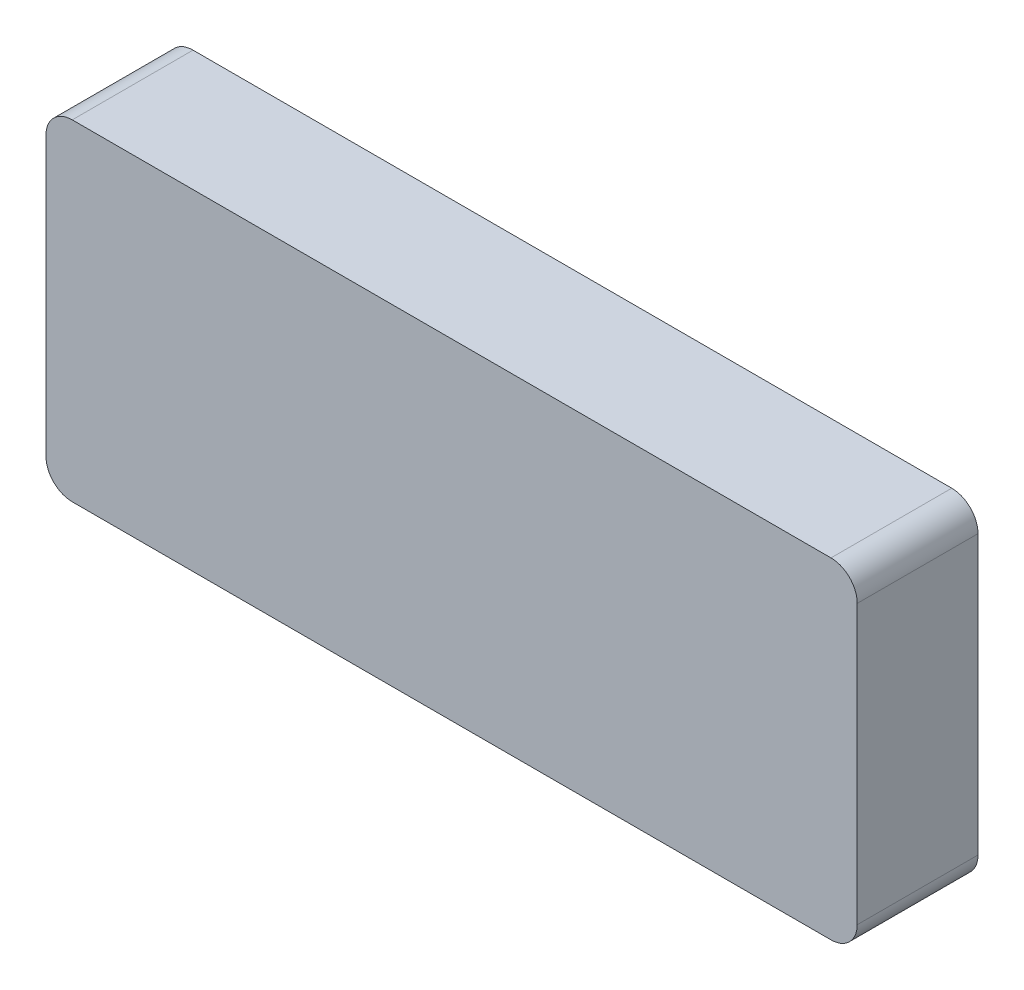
ISO-10303-21;
HEADER;
FILE_DESCRIPTION(('STEP AP214'),'2;1');
FILE_NAME('part.step','',(''),(''),'','','');
FILE_SCHEMA(('AUTOMOTIVE_DESIGN { 1 0 10303 214 1 1 1 1 }'));
ENDSEC;
DATA;
#1=APPLICATION_CONTEXT('core data for automotive mechanical design processes');
#2=APPLICATION_PROTOCOL_DEFINITION('international standard','automotive_design',2000,#1);
#3=PRODUCT_CONTEXT('',#1,'mechanical');
#4=PRODUCT('Part','Part','',(#3));
#5=PRODUCT_RELATED_PRODUCT_CATEGORY('part','',(#4));
#6=PRODUCT_DEFINITION_FORMATION('','',#4);
#7=PRODUCT_DEFINITION_CONTEXT('part definition',#1,'design');
#8=PRODUCT_DEFINITION('design','',#6,#7);
#9=PRODUCT_DEFINITION_SHAPE('','',#8);
#10=(LENGTH_UNIT() NAMED_UNIT(*) SI_UNIT(.MILLI.,.METRE.));
#11=(NAMED_UNIT(*) PLANE_ANGLE_UNIT() SI_UNIT($,.RADIAN.));
#12=(NAMED_UNIT(*) SI_UNIT($,.STERADIAN.) SOLID_ANGLE_UNIT());
#13=UNCERTAINTY_MEASURE_WITH_UNIT(LENGTH_MEASURE(1.E-05),#10,'distance_accuracy_value','');
#14=(GEOMETRIC_REPRESENTATION_CONTEXT(3) GLOBAL_UNCERTAINTY_ASSIGNED_CONTEXT((#13)) GLOBAL_UNIT_ASSIGNED_CONTEXT((#10,
#11,#12)) REPRESENTATION_CONTEXT('',''));
#15=CARTESIAN_POINT('',(0.,0.,0.));
#16=DIRECTION('',(0.,0.,1.));
#17=DIRECTION('',(1.,0.,0.));
#18=AXIS2_PLACEMENT_3D('',#15,#16,#17);
#19=CARTESIAN_POINT('',(12.60000274,42.60000116,0.));
#20=DIRECTION('',(0.,0.,1.));
#21=DIRECTION('',(1.,0.,0.));
#22=AXIS2_PLACEMENT_3D('',#19,#20,#21);
#23=PLANE('',#22);
#24=DIRECTION('',(0.,1.,0.));
#25=VECTOR('',#24,1.);
#26=CARTESIAN_POINT('',(74.4000036,42.60000116,0.));
#27=LINE('',#26,#25);
#28=CARTESIAN_POINT('',(74.4000036,19.4000033,0.));
#29=VERTEX_POINT('',#28);
#30=CARTESIAN_POINT('',(74.4000036,40.60000116,0.));
#31=VERTEX_POINT('',#30);
#32=EDGE_CURVE('E107',#29,#31,#27,.T.);
#33=ORIENTED_EDGE('',*,*,#32,.F.);
#34=CARTESIAN_POINT('',(72.4000036,19.4000033,0.));
#35=DIRECTION('',(0.,0.,1.));
#36=DIRECTION('',(1.,0.,0.));
#37=AXIS2_PLACEMENT_3D('',#34,#35,#36);
#38=CIRCLE('',#37,2.);
#39=CARTESIAN_POINT('',(72.4000036,17.4000033,0.));
#40=VERTEX_POINT('',#39);
#41=EDGE_CURVE('E114',#40,#29,#38,.T.);
#42=ORIENTED_EDGE('',*,*,#41,.F.);
#43=DIRECTION('',(1.,0.,0.));
#44=VECTOR('',#43,1.);
#45=CARTESIAN_POINT('',(74.4000036,17.4000033,0.));
#46=LINE('',#45,#44);
#47=CARTESIAN_POINT('',(14.60000274,17.4000033,0.));
#48=VERTEX_POINT('',#47);
#49=EDGE_CURVE('E112',#48,#40,#46,.T.);
#50=ORIENTED_EDGE('',*,*,#49,.F.);
#51=CARTESIAN_POINT('',(14.60000274,19.4000033,0.));
#52=DIRECTION('',(0.,0.,1.));
#53=DIRECTION('',(1.,0.,0.));
#54=AXIS2_PLACEMENT_3D('',#51,#52,#53);
#55=CIRCLE('',#54,2.);
#56=CARTESIAN_POINT('',(12.60000274,19.4000033,0.));
#57=VERTEX_POINT('',#56);
#58=EDGE_CURVE('E93',#57,#48,#55,.T.);
#59=ORIENTED_EDGE('',*,*,#58,.F.);
#60=DIRECTION('',(0.,1.,0.));
#61=VECTOR('',#60,1.);
#62=CARTESIAN_POINT('',(12.60000274,17.4000033,0.));
#63=LINE('',#62,#61);
#64=CARTESIAN_POINT('',(12.60000274,40.60000116,0.));
#65=VERTEX_POINT('',#64);
#66=EDGE_CURVE('E90',#65,#57,#63,.F.);
#67=ORIENTED_EDGE('',*,*,#66,.F.);
#68=CARTESIAN_POINT('',(14.60000274,40.60000116,0.));
#69=DIRECTION('',(0.,0.,1.));
#70=DIRECTION('',(1.,0.,0.));
#71=AXIS2_PLACEMENT_3D('',#68,#69,#70);
#72=CIRCLE('',#71,2.);
#73=CARTESIAN_POINT('',(14.60000274,42.60000116,0.));
#74=VERTEX_POINT('',#73);
#75=EDGE_CURVE('E19',#74,#65,#72,.T.);
#76=ORIENTED_EDGE('',*,*,#75,.F.);
#77=DIRECTION('',(1.,0.,0.));
#78=VECTOR('',#77,1.);
#79=CARTESIAN_POINT('',(12.60000274,42.60000116,0.));
#80=LINE('',#79,#78);
#81=CARTESIAN_POINT('',(72.4000036,42.60000116,0.));
#82=VERTEX_POINT('',#81);
#83=EDGE_CURVE('E88',#82,#74,#80,.F.);
#84=ORIENTED_EDGE('',*,*,#83,.F.);
#85=CARTESIAN_POINT('',(72.4000036,40.60000116,0.));
#86=DIRECTION('',(0.,0.,1.));
#87=DIRECTION('',(1.,0.,0.));
#88=AXIS2_PLACEMENT_3D('',#85,#86,#87);
#89=CIRCLE('',#88,2.);
#90=EDGE_CURVE('E109',#31,#82,#89,.T.);
#91=ORIENTED_EDGE('',*,*,#90,.F.);
#92=EDGE_LOOP('',(#33,#42,#50,#59,#67,#76,#84,#91));
#93=FACE_BOUND('',#92,.T.);
#94=ADVANCED_FACE('F16',(#93),#23,.F.);
#95=CARTESIAN_POINT('',(12.60000274,42.60000116,0.));
#96=DIRECTION('',(0.,1.,0.));
#97=DIRECTION('',(0.,0.,1.));
#98=AXIS2_PLACEMENT_3D('',#95,#96,#97);
#99=PLANE('',#98);
#100=ORIENTED_EDGE('',*,*,#83,.T.);
#101=DIRECTION('',(0.,0.,1.));
#102=VECTOR('',#101,1.);
#103=CARTESIAN_POINT('',(14.60000274,42.60000116,0.));
#104=LINE('',#103,#102);
#105=CARTESIAN_POINT('',(14.60000274,42.60000116,9.19999938));
#106=VERTEX_POINT('',#105);
#107=EDGE_CURVE('E87',#106,#74,#104,.F.);
#108=ORIENTED_EDGE('',*,*,#107,.F.);
#109=DIRECTION('',(1.,0.,0.));
#110=VECTOR('',#109,1.);
#111=CARTESIAN_POINT('',(12.60000274,42.60000116,9.19999938));
#112=LINE('',#111,#110);
#113=CARTESIAN_POINT('',(72.4000036,42.60000116,9.19999938));
#114=VERTEX_POINT('',#113);
#115=EDGE_CURVE('E126',#114,#106,#112,.F.);
#116=ORIENTED_EDGE('',*,*,#115,.F.);
#117=DIRECTION('',(0.,0.,1.));
#118=VECTOR('',#117,1.);
#119=CARTESIAN_POINT('',(72.4000036,42.60000116,0.));
#120=LINE('',#119,#118);
#121=EDGE_CURVE('E129',#82,#114,#120,.T.);
#122=ORIENTED_EDGE('',*,*,#121,.F.);
#123=EDGE_LOOP('',(#100,#108,#116,#122));
#124=FACE_BOUND('',#123,.T.);
#125=ADVANCED_FACE('F160',(#124),#99,.T.);
#126=CARTESIAN_POINT('',(14.60000274,40.60000116,0.));
#127=DIRECTION('',(0.,0.,1.));
#128=DIRECTION('',(1.,0.,0.));
#129=AXIS2_PLACEMENT_3D('',#126,#127,#128);
#130=CYLINDRICAL_SURFACE('',#129,2.);
#131=CARTESIAN_POINT('',(14.60000274,40.60000116,9.19999938));
#132=DIRECTION('',(0.,0.,1.));
#133=DIRECTION('',(1.,0.,0.));
#134=AXIS2_PLACEMENT_3D('',#131,#132,#133);
#135=CIRCLE('',#134,2.);
#136=CARTESIAN_POINT('',(12.60000274,40.60000116,9.19999938));
#137=VERTEX_POINT('',#136);
#138=EDGE_CURVE('E124',#106,#137,#135,.T.);
#139=ORIENTED_EDGE('',*,*,#138,.F.);
#140=ORIENTED_EDGE('',*,*,#107,.T.);
#141=ORIENTED_EDGE('',*,*,#75,.T.);
#142=DIRECTION('',(0.,0.,1.));
#143=VECTOR('',#142,1.);
#144=CARTESIAN_POINT('',(12.60000274,40.60000116,0.));
#145=LINE('',#144,#143);
#146=EDGE_CURVE('E85',#137,#65,#145,.F.);
#147=ORIENTED_EDGE('',*,*,#146,.F.);
#148=EDGE_LOOP('',(#139,#140,#141,#147));
#149=FACE_BOUND('',#148,.T.);
#150=ADVANCED_FACE('F83',(#149),#130,.T.);
#151=CARTESIAN_POINT('',(12.60000274,17.4000033,0.));
#152=DIRECTION('',(-1.,0.,0.));
#153=DIRECTION('',(0.,0.,1.));
#154=AXIS2_PLACEMENT_3D('',#151,#152,#153);
#155=PLANE('',#154);
#156=ORIENTED_EDGE('',*,*,#66,.T.);
#157=DIRECTION('',(0.,0.,1.));
#158=VECTOR('',#157,1.);
#159=CARTESIAN_POINT('',(12.60000274,19.4000033,0.));
#160=LINE('',#159,#158);
#161=CARTESIAN_POINT('',(12.60000274,19.4000033,9.19999938));
#162=VERTEX_POINT('',#161);
#163=EDGE_CURVE('E104',#162,#57,#160,.F.);
#164=ORIENTED_EDGE('',*,*,#163,.F.);
#165=DIRECTION('',(0.,1.,0.));
#166=VECTOR('',#165,1.);
#167=CARTESIAN_POINT('',(12.60000274,42.60000116,9.19999938));
#168=LINE('',#167,#166);
#169=EDGE_CURVE('E99',#137,#162,#168,.F.);
#170=ORIENTED_EDGE('',*,*,#169,.F.);
#171=ORIENTED_EDGE('',*,*,#146,.T.);
#172=EDGE_LOOP('',(#156,#164,#170,#171));
#173=FACE_BOUND('',#172,.T.);
#174=ADVANCED_FACE('F97',(#173),#155,.T.);
#175=CARTESIAN_POINT('',(14.60000274,19.4000033,0.));
#176=DIRECTION('',(0.,0.,1.));
#177=DIRECTION('',(1.,0.,0.));
#178=AXIS2_PLACEMENT_3D('',#175,#176,#177);
#179=CYLINDRICAL_SURFACE('',#178,2.);
#180=CARTESIAN_POINT('',(14.60000274,19.4000033,9.19999938));
#181=DIRECTION('',(0.,0.,1.));
#182=DIRECTION('',(1.,0.,0.));
#183=AXIS2_PLACEMENT_3D('',#180,#181,#182);
#184=CIRCLE('',#183,2.);
#185=CARTESIAN_POINT('',(14.60000274,17.4000033,9.19999938));
#186=VERTEX_POINT('',#185);
#187=EDGE_CURVE('E121',#162,#186,#184,.T.);
#188=ORIENTED_EDGE('',*,*,#187,.F.);
#189=ORIENTED_EDGE('',*,*,#163,.T.);
#190=ORIENTED_EDGE('',*,*,#58,.T.);
#191=DIRECTION('',(0.,0.,-1.));
#192=VECTOR('',#191,1.);
#193=CARTESIAN_POINT('',(14.60000274,17.4000033,0.));
#194=LINE('',#193,#192);
#195=EDGE_CURVE('E115',#186,#48,#194,.T.);
#196=ORIENTED_EDGE('',*,*,#195,.F.);
#197=EDGE_LOOP('',(#188,#189,#190,#196));
#198=FACE_BOUND('',#197,.T.);
#199=ADVANCED_FACE('F161',(#198),#179,.T.);
#200=CARTESIAN_POINT('',(74.4000036,17.4000033,0.));
#201=DIRECTION('',(0.,-1.,0.));
#202=DIRECTION('',(0.,0.,-1.));
#203=AXIS2_PLACEMENT_3D('',#200,#201,#202);
#204=PLANE('',#203);
#205=ORIENTED_EDGE('',*,*,#49,.T.);
#206=DIRECTION('',(0.,0.,1.));
#207=VECTOR('',#206,1.);
#208=CARTESIAN_POINT('',(72.4000036,17.4000033,0.));
#209=LINE('',#208,#207);
#210=CARTESIAN_POINT('',(72.4000036,17.4000033,9.19999938));
#211=VERTEX_POINT('',#210);
#212=EDGE_CURVE('E130',#211,#40,#209,.F.);
#213=ORIENTED_EDGE('',*,*,#212,.F.);
#214=DIRECTION('',(1.,0.,0.));
#215=VECTOR('',#214,1.);
#216=CARTESIAN_POINT('',(12.60000274,17.4000033,9.19999938));
#217=LINE('',#216,#215);
#218=EDGE_CURVE('E120',#186,#211,#217,.T.);
#219=ORIENTED_EDGE('',*,*,#218,.F.);
#220=ORIENTED_EDGE('',*,*,#195,.T.);
#221=EDGE_LOOP('',(#205,#213,#219,#220));
#222=FACE_BOUND('',#221,.T.);
#223=ADVANCED_FACE('F162',(#222),#204,.T.);
#224=CARTESIAN_POINT('',(72.4000036,19.4000033,0.));
#225=DIRECTION('',(0.,0.,1.));
#226=DIRECTION('',(1.,0.,0.));
#227=AXIS2_PLACEMENT_3D('',#224,#225,#226);
#228=CYLINDRICAL_SURFACE('',#227,2.);
#229=CARTESIAN_POINT('',(72.4000036,19.4000033,9.19999938));
#230=DIRECTION('',(0.,0.,1.));
#231=DIRECTION('',(1.,0.,0.));
#232=AXIS2_PLACEMENT_3D('',#229,#230,#231);
#233=CIRCLE('',#232,2.);
#234=CARTESIAN_POINT('',(74.4000036,19.4000033,9.19999938));
#235=VERTEX_POINT('',#234);
#236=EDGE_CURVE('E117',#211,#235,#233,.T.);
#237=ORIENTED_EDGE('',*,*,#236,.F.);
#238=ORIENTED_EDGE('',*,*,#212,.T.);
#239=ORIENTED_EDGE('',*,*,#41,.T.);
#240=DIRECTION('',(0.,0.,-1.));
#241=VECTOR('',#240,1.);
#242=CARTESIAN_POINT('',(74.4000036,19.4000033,0.));
#243=LINE('',#242,#241);
#244=EDGE_CURVE('E110',#235,#29,#243,.T.);
#245=ORIENTED_EDGE('',*,*,#244,.F.);
#246=EDGE_LOOP('',(#237,#238,#239,#245));
#247=FACE_BOUND('',#246,.T.);
#248=ADVANCED_FACE('F155',(#247),#228,.T.);
#249=CARTESIAN_POINT('',(74.4000036,42.60000116,0.));
#250=DIRECTION('',(1.,0.,0.));
#251=DIRECTION('',(0.,0.,-1.));
#252=AXIS2_PLACEMENT_3D('',#249,#250,#251);
#253=PLANE('',#252);
#254=ORIENTED_EDGE('',*,*,#32,.T.);
#255=DIRECTION('',(0.,0.,1.));
#256=VECTOR('',#255,1.);
#257=CARTESIAN_POINT('',(74.4000036,40.60000116,0.));
#258=LINE('',#257,#256);
#259=CARTESIAN_POINT('',(74.4000036,40.60000116,9.19999938));
#260=VERTEX_POINT('',#259);
#261=EDGE_CURVE('E34',#260,#31,#258,.F.);
#262=ORIENTED_EDGE('',*,*,#261,.F.);
#263=DIRECTION('',(0.,1.,0.));
#264=VECTOR('',#263,1.);
#265=CARTESIAN_POINT('',(74.4000036,42.60000116,9.19999938));
#266=LINE('',#265,#264);
#267=EDGE_CURVE('E25',#235,#260,#266,.T.);
#268=ORIENTED_EDGE('',*,*,#267,.F.);
#269=ORIENTED_EDGE('',*,*,#244,.T.);
#270=EDGE_LOOP('',(#254,#262,#268,#269));
#271=FACE_BOUND('',#270,.T.);
#272=ADVANCED_FACE('F153',(#271),#253,.T.);
#273=CARTESIAN_POINT('',(72.4000036,40.60000116,0.));
#274=DIRECTION('',(0.,0.,1.));
#275=DIRECTION('',(1.,0.,0.));
#276=AXIS2_PLACEMENT_3D('',#273,#274,#275);
#277=CYLINDRICAL_SURFACE('',#276,2.);
#278=CARTESIAN_POINT('',(72.4000036,40.60000116,9.19999938));
#279=DIRECTION('',(0.,0.,1.));
#280=DIRECTION('',(1.,0.,0.));
#281=AXIS2_PLACEMENT_3D('',#278,#279,#280);
#282=CIRCLE('',#281,2.);
#283=EDGE_CURVE('E10',#260,#114,#282,.T.);
#284=ORIENTED_EDGE('',*,*,#283,.F.);
#285=ORIENTED_EDGE('',*,*,#261,.T.);
#286=ORIENTED_EDGE('',*,*,#90,.T.);
#287=ORIENTED_EDGE('',*,*,#121,.T.);
#288=EDGE_LOOP('',(#284,#285,#286,#287));
#289=FACE_BOUND('',#288,.T.);
#290=ADVANCED_FACE('F158',(#289),#277,.T.);
#291=CARTESIAN_POINT('',(12.60000274,42.60000116,9.19999938));
#292=DIRECTION('',(0.,0.,1.));
#293=DIRECTION('',(1.,0.,0.));
#294=AXIS2_PLACEMENT_3D('',#291,#292,#293);
#295=PLANE('',#294);
#296=ORIENTED_EDGE('',*,*,#267,.T.);
#297=ORIENTED_EDGE('',*,*,#283,.T.);
#298=ORIENTED_EDGE('',*,*,#115,.T.);
#299=ORIENTED_EDGE('',*,*,#138,.T.);
#300=ORIENTED_EDGE('',*,*,#169,.T.);
#301=ORIENTED_EDGE('',*,*,#187,.T.);
#302=ORIENTED_EDGE('',*,*,#218,.T.);
#303=ORIENTED_EDGE('',*,*,#236,.T.);
#304=EDGE_LOOP('',(#296,#297,#298,#299,#300,#301,#302,#303));
#305=FACE_BOUND('',#304,.T.);
#306=ADVANCED_FACE('F151',(#305),#295,.T.);
#307=CLOSED_SHELL('',(#94,#125,#150,#174,#199,#223,#248,#272,#290,#306));
#308=MANIFOLD_SOLID_BREP('B1',#307);
#309=ADVANCED_BREP_SHAPE_REPRESENTATION('',(#18,#308),#14);
#310=SHAPE_DEFINITION_REPRESENTATION(#9,#309);
ENDSEC;
END-ISO-10303-21;
